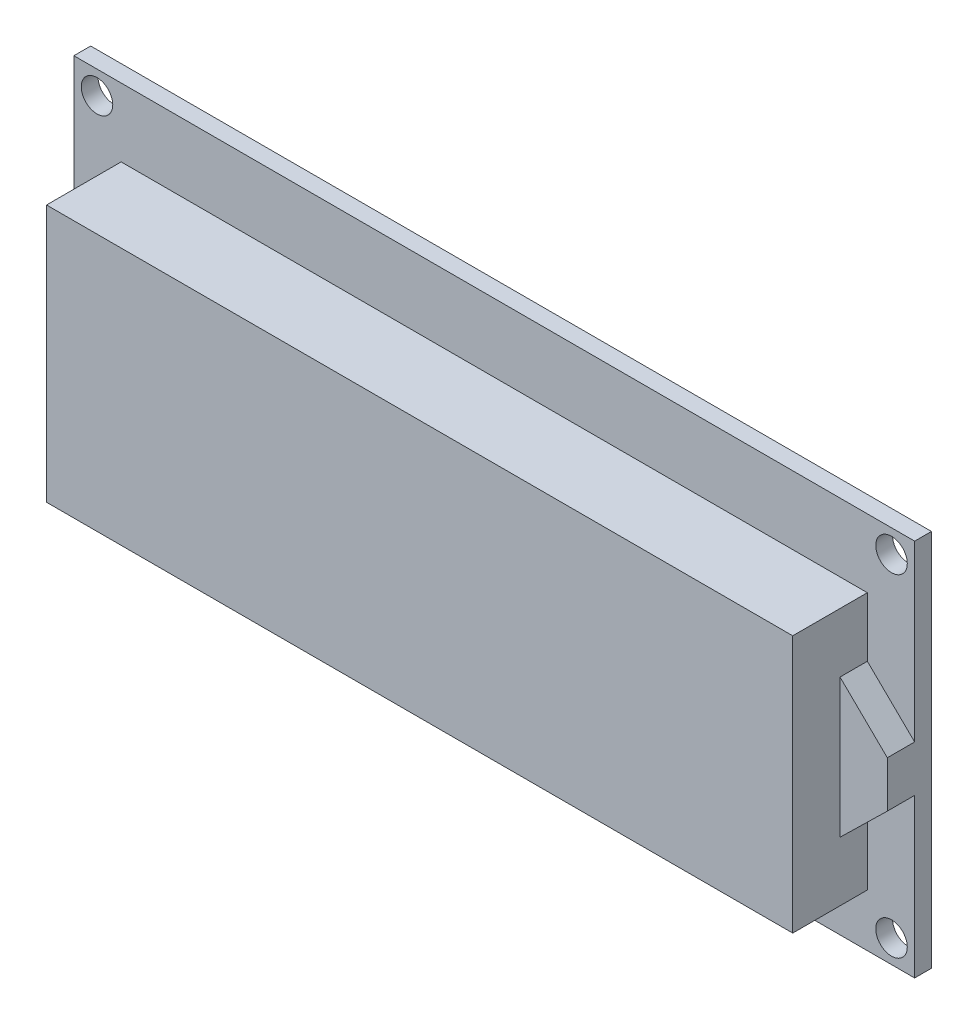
ISO-10303-21;
HEADER;
FILE_DESCRIPTION(('STEP AP214'),'2;1');
FILE_NAME('part.step','',(''),(''),'','','');
FILE_SCHEMA(('AUTOMOTIVE_DESIGN { 1 0 10303 214 1 1 1 1 }'));
ENDSEC;
DATA;
#1=APPLICATION_CONTEXT('core data for automotive mechanical design processes');
#2=APPLICATION_PROTOCOL_DEFINITION('international standard','automotive_design',2000,#1);
#3=PRODUCT_CONTEXT('',#1,'mechanical');
#4=PRODUCT('Part','Part','',(#3));
#5=PRODUCT_RELATED_PRODUCT_CATEGORY('part','',(#4));
#6=PRODUCT_DEFINITION_FORMATION('','',#4);
#7=PRODUCT_DEFINITION_CONTEXT('part definition',#1,'design');
#8=PRODUCT_DEFINITION('design','',#6,#7);
#9=PRODUCT_DEFINITION_SHAPE('','',#8);
#10=(LENGTH_UNIT() NAMED_UNIT(*) SI_UNIT(.MILLI.,.METRE.));
#11=(NAMED_UNIT(*) PLANE_ANGLE_UNIT() SI_UNIT($,.RADIAN.));
#12=(NAMED_UNIT(*) SI_UNIT($,.STERADIAN.) SOLID_ANGLE_UNIT());
#13=UNCERTAINTY_MEASURE_WITH_UNIT(LENGTH_MEASURE(1.E-05),#10,'distance_accuracy_value','');
#14=(GEOMETRIC_REPRESENTATION_CONTEXT(3) GLOBAL_UNCERTAINTY_ASSIGNED_CONTEXT((#13)) GLOBAL_UNIT_ASSIGNED_CONTEXT((#10,
#11,#12)) REPRESENTATION_CONTEXT('',''));
#15=CARTESIAN_POINT('',(0.,0.,0.));
#16=DIRECTION('',(0.,0.,1.));
#17=DIRECTION('',(1.,0.,0.));
#18=AXIS2_PLACEMENT_3D('',#15,#16,#17);
#19=CARTESIAN_POINT('',(0.,18.,-1.6));
#20=DIRECTION('',(0.,1.,0.));
#21=DIRECTION('',(-1.,0.,0.));
#22=AXIS2_PLACEMENT_3D('',#19,#20,#21);
#23=PLANE('',#22);
#24=DIRECTION('',(-1.,0.,0.));
#25=VECTOR('',#24,1.);
#26=CARTESIAN_POINT('',(0.,18.,0.));
#27=LINE('',#26,#25);
#28=CARTESIAN_POINT('',(40.,18.,0.));
#29=VERTEX_POINT('',#28);
#30=CARTESIAN_POINT('',(-40.,18.,0.));
#31=VERTEX_POINT('',#30);
#32=EDGE_CURVE('E223',#29,#31,#27,.T.);
#33=ORIENTED_EDGE('',*,*,#32,.F.);
#34=DIRECTION('',(0.,0.,1.));
#35=VECTOR('',#34,1.);
#36=CARTESIAN_POINT('',(40.,18.,-1.6));
#37=LINE('',#36,#35);
#38=CARTESIAN_POINT('',(40.,18.,-1.6));
#39=VERTEX_POINT('',#38);
#40=EDGE_CURVE('E71',#39,#29,#37,.T.);
#41=ORIENTED_EDGE('',*,*,#40,.F.);
#42=DIRECTION('',(-1.,0.,0.));
#43=VECTOR('',#42,1.);
#44=CARTESIAN_POINT('',(0.,18.,-1.6));
#45=LINE('',#44,#43);
#46=CARTESIAN_POINT('',(-40.,18.,-1.6));
#47=VERTEX_POINT('',#46);
#48=EDGE_CURVE('E239',#39,#47,#45,.T.);
#49=ORIENTED_EDGE('',*,*,#48,.T.);
#50=DIRECTION('',(0.,0.,1.));
#51=VECTOR('',#50,1.);
#52=CARTESIAN_POINT('',(-40.,18.,-1.6));
#53=LINE('',#52,#51);
#54=EDGE_CURVE('E12',#47,#31,#53,.T.);
#55=ORIENTED_EDGE('',*,*,#54,.T.);
#56=EDGE_LOOP('',(#33,#41,#49,#55));
#57=FACE_BOUND('',#56,.T.);
#58=ADVANCED_FACE('F62',(#57),#23,.T.);
#59=CARTESIAN_POINT('',(40.,0.,-1.6));
#60=DIRECTION('',(1.,0.,0.));
#61=DIRECTION('',(0.,0.,-1.));
#62=AXIS2_PLACEMENT_3D('',#59,#60,#61);
#63=PLANE('',#62);
#64=DIRECTION('',(0.,1.,0.));
#65=VECTOR('',#64,1.);
#66=CARTESIAN_POINT('',(40.,0.,0.));
#67=LINE('',#66,#65);
#68=CARTESIAN_POINT('',(40.,-18.,0.));
#69=VERTEX_POINT('',#68);
#70=CARTESIAN_POINT('',(40.,-2.95,0.));
#71=VERTEX_POINT('',#70);
#72=EDGE_CURVE('E86',#69,#71,#67,.T.);
#73=ORIENTED_EDGE('',*,*,#72,.F.);
#74=DIRECTION('',(0.,0.,1.));
#75=VECTOR('',#74,1.);
#76=CARTESIAN_POINT('',(40.,-18.,-1.6));
#77=LINE('',#76,#75);
#78=CARTESIAN_POINT('',(40.,-18.,-1.6));
#79=VERTEX_POINT('',#78);
#80=EDGE_CURVE('E263',#79,#69,#77,.T.);
#81=ORIENTED_EDGE('',*,*,#80,.F.);
#82=DIRECTION('',(0.,1.,0.));
#83=VECTOR('',#82,1.);
#84=CARTESIAN_POINT('',(40.,0.,-1.6));
#85=LINE('',#84,#83);
#86=EDGE_CURVE('E236',#79,#39,#85,.T.);
#87=ORIENTED_EDGE('',*,*,#86,.T.);
#88=ORIENTED_EDGE('',*,*,#40,.T.);
#89=CARTESIAN_POINT('',(40.,1.45,0.));
#90=VERTEX_POINT('',#89);
#91=EDGE_CURVE('E258',#90,#29,#67,.T.);
#92=ORIENTED_EDGE('',*,*,#91,.F.);
#93=DIRECTION('',(0.,0.,-1.));
#94=VECTOR('',#93,1.);
#95=CARTESIAN_POINT('',(40.,1.45,2.6));
#96=LINE('',#95,#94);
#97=CARTESIAN_POINT('',(40.,1.45,2.6));
#98=VERTEX_POINT('',#97);
#99=EDGE_CURVE('E178',#98,#90,#96,.T.);
#100=ORIENTED_EDGE('',*,*,#99,.F.);
#101=DIRECTION('',(0.,1.,0.));
#102=VECTOR('',#101,1.);
#103=CARTESIAN_POINT('',(40.,0.,2.6));
#104=LINE('',#103,#102);
#105=CARTESIAN_POINT('',(40.,-2.95,2.6));
#106=VERTEX_POINT('',#105);
#107=EDGE_CURVE('E176',#106,#98,#104,.T.);
#108=ORIENTED_EDGE('',*,*,#107,.F.);
#109=DIRECTION('',(0.,0.,-1.));
#110=VECTOR('',#109,1.);
#111=CARTESIAN_POINT('',(40.,-2.95,2.6));
#112=LINE('',#111,#110);
#113=EDGE_CURVE('E164',#106,#71,#112,.T.);
#114=ORIENTED_EDGE('',*,*,#113,.T.);
#115=EDGE_LOOP('',(#73,#81,#87,#88,#92,#100,#108,#114));
#116=FACE_BOUND('',#115,.T.);
#117=ADVANCED_FACE('F283',(#116),#63,.T.);
#118=CARTESIAN_POINT('',(0.,-18.,-1.6));
#119=DIRECTION('',(0.,1.,0.));
#120=DIRECTION('',(-1.,0.,0.));
#121=AXIS2_PLACEMENT_3D('',#118,#119,#120);
#122=PLANE('',#121);
#123=DIRECTION('',(-1.,0.,0.));
#124=VECTOR('',#123,1.);
#125=CARTESIAN_POINT('',(0.,-18.,0.));
#126=LINE('',#125,#124);
#127=CARTESIAN_POINT('',(-40.,-18.,0.));
#128=VERTEX_POINT('',#127);
#129=EDGE_CURVE('E256',#69,#128,#126,.T.);
#130=ORIENTED_EDGE('',*,*,#129,.T.);
#131=DIRECTION('',(0.,0.,1.));
#132=VECTOR('',#131,1.);
#133=CARTESIAN_POINT('',(-40.,-18.,-1.6));
#134=LINE('',#133,#132);
#135=CARTESIAN_POINT('',(-40.,-18.,-1.6));
#136=VERTEX_POINT('',#135);
#137=EDGE_CURVE('E66',#136,#128,#134,.T.);
#138=ORIENTED_EDGE('',*,*,#137,.F.);
#139=DIRECTION('',(-1.,0.,0.));
#140=VECTOR('',#139,1.);
#141=CARTESIAN_POINT('',(0.,-18.,-1.6));
#142=LINE('',#141,#140);
#143=EDGE_CURVE('E234',#79,#136,#142,.T.);
#144=ORIENTED_EDGE('',*,*,#143,.F.);
#145=ORIENTED_EDGE('',*,*,#80,.T.);
#146=EDGE_LOOP('',(#130,#138,#144,#145));
#147=FACE_BOUND('',#146,.T.);
#148=ADVANCED_FACE('F281',(#147),#122,.F.);
#149=CARTESIAN_POINT('',(-40.,0.,-1.6));
#150=DIRECTION('',(1.,0.,0.));
#151=DIRECTION('',(0.,0.,-1.));
#152=AXIS2_PLACEMENT_3D('',#149,#150,#151);
#153=PLANE('',#152);
#154=DIRECTION('',(0.,1.,0.));
#155=VECTOR('',#154,1.);
#156=CARTESIAN_POINT('',(-40.,0.,0.));
#157=LINE('',#156,#155);
#158=EDGE_CURVE('E253',#128,#31,#157,.T.);
#159=ORIENTED_EDGE('',*,*,#158,.T.);
#160=ORIENTED_EDGE('',*,*,#54,.F.);
#161=DIRECTION('',(0.,1.,0.));
#162=VECTOR('',#161,1.);
#163=CARTESIAN_POINT('',(-40.,0.,-1.6));
#164=LINE('',#163,#162);
#165=EDGE_CURVE('E232',#136,#47,#164,.T.);
#166=ORIENTED_EDGE('',*,*,#165,.F.);
#167=ORIENTED_EDGE('',*,*,#137,.T.);
#168=EDGE_LOOP('',(#159,#160,#166,#167));
#169=FACE_BOUND('',#168,.T.);
#170=ADVANCED_FACE('F271',(#169),#153,.F.);
#171=CARTESIAN_POINT('',(-37.8,-15.8,-1.6));
#172=DIRECTION('',(0.,0.,1.));
#173=DIRECTION('',(1.,0.,0.));
#174=AXIS2_PLACEMENT_3D('',#171,#172,#173);
#175=CYLINDRICAL_SURFACE('',#174,1.5);
#176=CARTESIAN_POINT('',(-37.8,-15.8,-1.6));
#177=DIRECTION('',(0.,0.,1.));
#178=DIRECTION('',(1.,0.,0.));
#179=AXIS2_PLACEMENT_3D('',#176,#177,#178);
#180=CIRCLE('',#179,1.5);
#181=CARTESIAN_POINT('',(-36.3,-15.8,-1.6));
#182=VERTEX_POINT('',#181);
#183=EDGE_CURVE('E229',#182,#182,#180,.T.);
#184=ORIENTED_EDGE('',*,*,#183,.F.);
#185=EDGE_LOOP('',(#184));
#186=FACE_BOUND('',#185,.T.);
#187=CARTESIAN_POINT('',(-37.8,-15.8,0.));
#188=DIRECTION('',(0.,0.,1.));
#189=DIRECTION('',(1.,0.,0.));
#190=AXIS2_PLACEMENT_3D('',#187,#188,#189);
#191=CIRCLE('',#190,1.5);
#192=CARTESIAN_POINT('',(-36.3,-15.8,0.));
#193=VERTEX_POINT('',#192);
#194=EDGE_CURVE('E250',#193,#193,#191,.T.);
#195=ORIENTED_EDGE('',*,*,#194,.T.);
#196=EDGE_LOOP('',(#195));
#197=FACE_BOUND('',#196,.T.);
#198=ADVANCED_FACE('F289',(#186,#197),#175,.F.);
#199=CARTESIAN_POINT('',(-37.8,15.8,-1.6));
#200=DIRECTION('',(0.,0.,1.));
#201=DIRECTION('',(1.,0.,0.));
#202=AXIS2_PLACEMENT_3D('',#199,#200,#201);
#203=CYLINDRICAL_SURFACE('',#202,1.5);
#204=CARTESIAN_POINT('',(-37.8,15.8,-1.6));
#205=DIRECTION('',(0.,0.,1.));
#206=DIRECTION('',(1.,0.,0.));
#207=AXIS2_PLACEMENT_3D('',#204,#205,#206);
#208=CIRCLE('',#207,1.5);
#209=CARTESIAN_POINT('',(-36.3,15.8,-1.6));
#210=VERTEX_POINT('',#209);
#211=EDGE_CURVE('E226',#210,#210,#208,.T.);
#212=ORIENTED_EDGE('',*,*,#211,.F.);
#213=EDGE_LOOP('',(#212));
#214=FACE_BOUND('',#213,.T.);
#215=CARTESIAN_POINT('',(-37.8,15.8,0.));
#216=DIRECTION('',(0.,0.,1.));
#217=DIRECTION('',(1.,0.,0.));
#218=AXIS2_PLACEMENT_3D('',#215,#216,#217);
#219=CIRCLE('',#218,1.5);
#220=CARTESIAN_POINT('',(-36.3,15.8,0.));
#221=VERTEX_POINT('',#220);
#222=EDGE_CURVE('E247',#221,#221,#219,.T.);
#223=ORIENTED_EDGE('',*,*,#222,.T.);
#224=EDGE_LOOP('',(#223));
#225=FACE_BOUND('',#224,.T.);
#226=ADVANCED_FACE('F380',(#214,#225),#203,.F.);
#227=CARTESIAN_POINT('',(37.8,15.8,-1.6));
#228=DIRECTION('',(0.,0.,1.));
#229=DIRECTION('',(1.,0.,0.));
#230=AXIS2_PLACEMENT_3D('',#227,#228,#229);
#231=CYLINDRICAL_SURFACE('',#230,1.5);
#232=CARTESIAN_POINT('',(37.8,15.8,-1.6));
#233=DIRECTION('',(0.,0.,1.));
#234=DIRECTION('',(1.,0.,0.));
#235=AXIS2_PLACEMENT_3D('',#232,#233,#234);
#236=CIRCLE('',#235,1.5);
#237=CARTESIAN_POINT('',(39.3,15.8,-1.6));
#238=VERTEX_POINT('',#237);
#239=EDGE_CURVE('E222',#238,#238,#236,.T.);
#240=ORIENTED_EDGE('',*,*,#239,.F.);
#241=EDGE_LOOP('',(#240));
#242=FACE_BOUND('',#241,.T.);
#243=CARTESIAN_POINT('',(37.8,15.8,0.));
#244=DIRECTION('',(0.,0.,1.));
#245=DIRECTION('',(1.,0.,0.));
#246=AXIS2_PLACEMENT_3D('',#243,#244,#245);
#247=CIRCLE('',#246,1.5);
#248=CARTESIAN_POINT('',(39.3,15.8,0.));
#249=VERTEX_POINT('',#248);
#250=EDGE_CURVE('E244',#249,#249,#247,.T.);
#251=ORIENTED_EDGE('',*,*,#250,.T.);
#252=EDGE_LOOP('',(#251));
#253=FACE_BOUND('',#252,.T.);
#254=ADVANCED_FACE('F373',(#242,#253),#231,.F.);
#255=CARTESIAN_POINT('',(37.8,-15.8,-1.6));
#256=DIRECTION('',(0.,0.,1.));
#257=DIRECTION('',(1.,0.,0.));
#258=AXIS2_PLACEMENT_3D('',#255,#256,#257);
#259=CYLINDRICAL_SURFACE('',#258,1.5);
#260=CARTESIAN_POINT('',(37.8,-15.8,-1.6));
#261=DIRECTION('',(0.,0.,1.));
#262=DIRECTION('',(1.,0.,0.));
#263=AXIS2_PLACEMENT_3D('',#260,#261,#262);
#264=CIRCLE('',#263,1.5);
#265=CARTESIAN_POINT('',(39.3,-15.8,-1.6));
#266=VERTEX_POINT('',#265);
#267=EDGE_CURVE('E219',#266,#266,#264,.T.);
#268=ORIENTED_EDGE('',*,*,#267,.F.);
#269=EDGE_LOOP('',(#268));
#270=FACE_BOUND('',#269,.T.);
#271=CARTESIAN_POINT('',(37.8,-15.8,0.));
#272=DIRECTION('',(0.,0.,1.));
#273=DIRECTION('',(1.,0.,0.));
#274=AXIS2_PLACEMENT_3D('',#271,#272,#273);
#275=CIRCLE('',#274,1.5);
#276=CARTESIAN_POINT('',(39.3,-15.8,0.));
#277=VERTEX_POINT('',#276);
#278=EDGE_CURVE('E218',#277,#277,#275,.T.);
#279=ORIENTED_EDGE('',*,*,#278,.T.);
#280=EDGE_LOOP('',(#279));
#281=FACE_BOUND('',#280,.T.);
#282=ADVANCED_FACE('F64',(#270,#281),#259,.F.);
#283=CARTESIAN_POINT('',(0.,0.,0.));
#284=DIRECTION('',(0.,0.,1.));
#285=DIRECTION('',(1.,0.,0.));
#286=AXIS2_PLACEMENT_3D('',#283,#284,#285);
#287=PLANE('',#286);
#288=DIRECTION('',(0.715006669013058,-0.699117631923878,0.));
#289=VECTOR('',#288,1.);
#290=CARTESIAN_POINT('',(20.2754354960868,20.7362408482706,0.));
#291=LINE('',#290,#289);
#292=CARTESIAN_POINT('',(35.5,5.85,0.));
#293=VERTEX_POINT('',#292);
#294=EDGE_CURVE('E79',#293,#90,#291,.T.);
#295=ORIENTED_EDGE('',*,*,#294,.T.);
#296=ORIENTED_EDGE('',*,*,#91,.T.);
#297=ORIENTED_EDGE('',*,*,#32,.T.);
#298=ORIENTED_EDGE('',*,*,#158,.F.);
#299=ORIENTED_EDGE('',*,*,#129,.F.);
#300=ORIENTED_EDGE('',*,*,#72,.T.);
#301=DIRECTION('',(-0.715006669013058,-0.699117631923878,0.));
#302=VECTOR('',#301,1.);
#303=CARTESIAN_POINT('',(21.0252461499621,-21.5030926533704,0.));
#304=LINE('',#303,#302);
#305=CARTESIAN_POINT('',(35.5,-7.34999999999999,0.));
#306=VERTEX_POINT('',#305);
#307=EDGE_CURVE('E183',#71,#306,#304,.T.);
#308=ORIENTED_EDGE('',*,*,#307,.T.);
#309=DIRECTION('',(0.,-1.,0.));
#310=VECTOR('',#309,1.);
#311=CARTESIAN_POINT('',(35.5,0.,0.));
#312=LINE('',#311,#310);
#313=CARTESIAN_POINT('',(35.5,-13.,0.));
#314=VERTEX_POINT('',#313);
#315=EDGE_CURVE('E159',#306,#314,#312,.T.);
#316=ORIENTED_EDGE('',*,*,#315,.T.);
#317=DIRECTION('',(1.,0.,0.));
#318=VECTOR('',#317,1.);
#319=CARTESIAN_POINT('',(0.,-13.,0.));
#320=LINE('',#319,#318);
#321=CARTESIAN_POINT('',(-35.5,-13.,0.));
#322=VERTEX_POINT('',#321);
#323=EDGE_CURVE('E193',#322,#314,#320,.T.);
#324=ORIENTED_EDGE('',*,*,#323,.F.);
#325=DIRECTION('',(0.,-1.,0.));
#326=VECTOR('',#325,1.);
#327=CARTESIAN_POINT('',(-35.5,0.,0.));
#328=LINE('',#327,#326);
#329=CARTESIAN_POINT('',(-35.5,11.5,0.));
#330=VERTEX_POINT('',#329);
#331=EDGE_CURVE('E206',#330,#322,#328,.T.);
#332=ORIENTED_EDGE('',*,*,#331,.F.);
#333=DIRECTION('',(1.,0.,0.));
#334=VECTOR('',#333,1.);
#335=CARTESIAN_POINT('',(0.,11.5,0.));
#336=LINE('',#335,#334);
#337=CARTESIAN_POINT('',(35.5,11.5,0.));
#338=VERTEX_POINT('',#337);
#339=EDGE_CURVE('E203',#330,#338,#336,.T.);
#340=ORIENTED_EDGE('',*,*,#339,.T.);
#341=EDGE_CURVE('E201',#338,#293,#312,.T.);
#342=ORIENTED_EDGE('',*,*,#341,.T.);
#343=EDGE_LOOP('',(#295,#296,#297,#298,#299,#300,#308,#316,#324,#332,#340,#342));
#344=FACE_BOUND('',#343,.T.);
#345=ORIENTED_EDGE('',*,*,#278,.F.);
#346=EDGE_LOOP('',(#345));
#347=FACE_BOUND('',#346,.T.);
#348=ORIENTED_EDGE('',*,*,#250,.F.);
#349=EDGE_LOOP('',(#348));
#350=FACE_BOUND('',#349,.T.);
#351=ORIENTED_EDGE('',*,*,#222,.F.);
#352=EDGE_LOOP('',(#351));
#353=FACE_BOUND('',#352,.T.);
#354=ORIENTED_EDGE('',*,*,#194,.F.);
#355=EDGE_LOOP('',(#354));
#356=FACE_BOUND('',#355,.T.);
#357=ADVANCED_FACE('F273',(#344,#347,#350,#353,#356),#287,.T.);
#358=CARTESIAN_POINT('',(0.,0.,-1.6));
#359=DIRECTION('',(0.,0.,1.));
#360=DIRECTION('',(1.,0.,0.));
#361=AXIS2_PLACEMENT_3D('',#358,#359,#360);
#362=PLANE('',#361);
#363=ORIENTED_EDGE('',*,*,#267,.T.);
#364=EDGE_LOOP('',(#363));
#365=FACE_BOUND('',#364,.T.);
#366=ORIENTED_EDGE('',*,*,#239,.T.);
#367=EDGE_LOOP('',(#366));
#368=FACE_BOUND('',#367,.T.);
#369=ORIENTED_EDGE('',*,*,#211,.T.);
#370=EDGE_LOOP('',(#369));
#371=FACE_BOUND('',#370,.T.);
#372=ORIENTED_EDGE('',*,*,#183,.T.);
#373=EDGE_LOOP('',(#372));
#374=FACE_BOUND('',#373,.T.);
#375=ORIENTED_EDGE('',*,*,#165,.T.);
#376=ORIENTED_EDGE('',*,*,#48,.F.);
#377=ORIENTED_EDGE('',*,*,#86,.F.);
#378=ORIENTED_EDGE('',*,*,#143,.T.);
#379=EDGE_LOOP('',(#375,#376,#377,#378));
#380=FACE_BOUND('',#379,.T.);
#381=ADVANCED_FACE('F280',(#365,#368,#371,#374,#380),#362,.F.);
#382=CARTESIAN_POINT('',(35.5,0.,7.1));
#383=DIRECTION('',(1.,0.,0.));
#384=DIRECTION('',(0.,1.,0.));
#385=AXIS2_PLACEMENT_3D('',#382,#383,#384);
#386=PLANE('',#385);
#387=DIRECTION('',(0.,0.,-1.));
#388=VECTOR('',#387,1.);
#389=CARTESIAN_POINT('',(35.5,5.85,2.6));
#390=LINE('',#389,#388);
#391=CARTESIAN_POINT('',(35.5,5.85,2.6));
#392=VERTEX_POINT('',#391);
#393=EDGE_CURVE('E163',#392,#293,#390,.T.);
#394=ORIENTED_EDGE('',*,*,#393,.T.);
#395=ORIENTED_EDGE('',*,*,#341,.F.);
#396=DIRECTION('',(0.,0.,-1.));
#397=VECTOR('',#396,1.);
#398=CARTESIAN_POINT('',(35.5,11.5,7.1));
#399=LINE('',#398,#397);
#400=CARTESIAN_POINT('',(35.5,11.5,7.1));
#401=VERTEX_POINT('',#400);
#402=EDGE_CURVE('E216',#401,#338,#399,.T.);
#403=ORIENTED_EDGE('',*,*,#402,.F.);
#404=DIRECTION('',(0.,-1.,0.));
#405=VECTOR('',#404,1.);
#406=CARTESIAN_POINT('',(35.5,0.,7.1));
#407=LINE('',#406,#405);
#408=CARTESIAN_POINT('',(35.5,-13.,7.1));
#409=VERTEX_POINT('',#408);
#410=EDGE_CURVE('E189',#401,#409,#407,.T.);
#411=ORIENTED_EDGE('',*,*,#410,.T.);
#412=DIRECTION('',(0.,0.,-1.));
#413=VECTOR('',#412,1.);
#414=CARTESIAN_POINT('',(35.5,-13.,7.1));
#415=LINE('',#414,#413);
#416=EDGE_CURVE('E200',#409,#314,#415,.T.);
#417=ORIENTED_EDGE('',*,*,#416,.T.);
#418=ORIENTED_EDGE('',*,*,#315,.F.);
#419=DIRECTION('',(0.,0.,-1.));
#420=VECTOR('',#419,1.);
#421=CARTESIAN_POINT('',(35.5,-7.34999999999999,2.6));
#422=LINE('',#421,#420);
#423=CARTESIAN_POINT('',(35.5,-7.34999999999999,2.6));
#424=VERTEX_POINT('',#423);
#425=EDGE_CURVE('E153',#424,#306,#422,.T.);
#426=ORIENTED_EDGE('',*,*,#425,.F.);
#427=DIRECTION('',(0.,-1.,0.));
#428=VECTOR('',#427,1.);
#429=CARTESIAN_POINT('',(35.5,0.,2.6));
#430=LINE('',#429,#428);
#431=EDGE_CURVE('E156',#392,#424,#430,.T.);
#432=ORIENTED_EDGE('',*,*,#431,.F.);
#433=EDGE_LOOP('',(#394,#395,#403,#411,#417,#418,#426,#432));
#434=FACE_BOUND('',#433,.T.);
#435=ADVANCED_FACE('F155',(#434),#386,.T.);
#436=CARTESIAN_POINT('',(0.,11.5,7.1));
#437=DIRECTION('',(0.,1.,0.));
#438=DIRECTION('',(0.,0.,1.));
#439=AXIS2_PLACEMENT_3D('',#436,#437,#438);
#440=PLANE('',#439);
#441=ORIENTED_EDGE('',*,*,#339,.F.);
#442=DIRECTION('',(0.,0.,-1.));
#443=VECTOR('',#442,1.);
#444=CARTESIAN_POINT('',(-35.5,11.5,7.1));
#445=LINE('',#444,#443);
#446=CARTESIAN_POINT('',(-35.5,11.5,7.1));
#447=VERTEX_POINT('',#446);
#448=EDGE_CURVE('E214',#447,#330,#445,.T.);
#449=ORIENTED_EDGE('',*,*,#448,.F.);
#450=DIRECTION('',(1.,0.,0.));
#451=VECTOR('',#450,1.);
#452=CARTESIAN_POINT('',(0.,11.5,7.1));
#453=LINE('',#452,#451);
#454=EDGE_CURVE('E192',#447,#401,#453,.T.);
#455=ORIENTED_EDGE('',*,*,#454,.T.);
#456=ORIENTED_EDGE('',*,*,#402,.T.);
#457=EDGE_LOOP('',(#441,#449,#455,#456));
#458=FACE_BOUND('',#457,.T.);
#459=ADVANCED_FACE('F305',(#458),#440,.T.);
#460=CARTESIAN_POINT('',(-35.5,0.,7.1));
#461=DIRECTION('',(1.,0.,0.));
#462=DIRECTION('',(0.,1.,0.));
#463=AXIS2_PLACEMENT_3D('',#460,#461,#462);
#464=PLANE('',#463);
#465=ORIENTED_EDGE('',*,*,#331,.T.);
#466=DIRECTION('',(0.,0.,-1.));
#467=VECTOR('',#466,1.);
#468=CARTESIAN_POINT('',(-35.5,-13.,7.1));
#469=LINE('',#468,#467);
#470=CARTESIAN_POINT('',(-35.5,-13.,7.1));
#471=VERTEX_POINT('',#470);
#472=EDGE_CURVE('E212',#471,#322,#469,.T.);
#473=ORIENTED_EDGE('',*,*,#472,.F.);
#474=DIRECTION('',(0.,-1.,0.));
#475=VECTOR('',#474,1.);
#476=CARTESIAN_POINT('',(-35.5,0.,7.1));
#477=LINE('',#476,#475);
#478=EDGE_CURVE('E196',#447,#471,#477,.T.);
#479=ORIENTED_EDGE('',*,*,#478,.F.);
#480=ORIENTED_EDGE('',*,*,#448,.T.);
#481=EDGE_LOOP('',(#465,#473,#479,#480));
#482=FACE_BOUND('',#481,.T.);
#483=ADVANCED_FACE('F308',(#482),#464,.F.);
#484=CARTESIAN_POINT('',(0.,-13.,7.1));
#485=DIRECTION('',(0.,1.,0.));
#486=DIRECTION('',(-1.,0.,0.));
#487=AXIS2_PLACEMENT_3D('',#484,#485,#486);
#488=PLANE('',#487);
#489=ORIENTED_EDGE('',*,*,#323,.T.);
#490=ORIENTED_EDGE('',*,*,#416,.F.);
#491=DIRECTION('',(1.,0.,0.));
#492=VECTOR('',#491,1.);
#493=CARTESIAN_POINT('',(0.,-13.,7.1));
#494=LINE('',#493,#492);
#495=EDGE_CURVE('E198',#471,#409,#494,.T.);
#496=ORIENTED_EDGE('',*,*,#495,.F.);
#497=ORIENTED_EDGE('',*,*,#472,.T.);
#498=EDGE_LOOP('',(#489,#490,#496,#497));
#499=FACE_BOUND('',#498,.T.);
#500=ADVANCED_FACE('F312',(#499),#488,.F.);
#501=CARTESIAN_POINT('',(0.,0.,7.1));
#502=DIRECTION('',(0.,0.,1.));
#503=DIRECTION('',(1.,0.,0.));
#504=AXIS2_PLACEMENT_3D('',#501,#502,#503);
#505=PLANE('',#504);
#506=ORIENTED_EDGE('',*,*,#410,.F.);
#507=ORIENTED_EDGE('',*,*,#454,.F.);
#508=ORIENTED_EDGE('',*,*,#478,.T.);
#509=ORIENTED_EDGE('',*,*,#495,.T.);
#510=EDGE_LOOP('',(#506,#507,#508,#509));
#511=FACE_BOUND('',#510,.T.);
#512=ADVANCED_FACE('F316',(#511),#505,.T.);
#513=CARTESIAN_POINT('',(20.2754354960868,20.7362408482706,2.6));
#514=DIRECTION('',(0.699117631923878,0.715006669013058,0.));
#515=DIRECTION('',(-0.715006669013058,0.699117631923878,0.));
#516=AXIS2_PLACEMENT_3D('',#513,#514,#515);
#517=PLANE('',#516);
#518=ORIENTED_EDGE('',*,*,#294,.F.);
#519=ORIENTED_EDGE('',*,*,#393,.F.);
#520=DIRECTION('',(0.715006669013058,-0.699117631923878,0.));
#521=VECTOR('',#520,1.);
#522=CARTESIAN_POINT('',(20.2754354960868,20.7362408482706,2.6));
#523=LINE('',#522,#521);
#524=EDGE_CURVE('E172',#392,#98,#523,.T.);
#525=ORIENTED_EDGE('',*,*,#524,.T.);
#526=ORIENTED_EDGE('',*,*,#99,.T.);
#527=EDGE_LOOP('',(#518,#519,#525,#526));
#528=FACE_BOUND('',#527,.T.);
#529=ADVANCED_FACE('F320',(#528),#517,.T.);
#530=CARTESIAN_POINT('',(21.0252461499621,-21.5030926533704,2.6));
#531=DIRECTION('',(0.699117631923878,-0.715006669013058,0.));
#532=DIRECTION('',(0.715006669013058,0.699117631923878,0.));
#533=AXIS2_PLACEMENT_3D('',#530,#531,#532);
#534=PLANE('',#533);
#535=ORIENTED_EDGE('',*,*,#307,.F.);
#536=ORIENTED_EDGE('',*,*,#113,.F.);
#537=DIRECTION('',(-0.715006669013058,-0.699117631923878,0.));
#538=VECTOR('',#537,1.);
#539=CARTESIAN_POINT('',(21.0252461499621,-21.5030926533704,2.6));
#540=LINE('',#539,#538);
#541=EDGE_CURVE('E170',#106,#424,#540,.T.);
#542=ORIENTED_EDGE('',*,*,#541,.T.);
#543=ORIENTED_EDGE('',*,*,#425,.T.);
#544=EDGE_LOOP('',(#535,#536,#542,#543));
#545=FACE_BOUND('',#544,.T.);
#546=ADVANCED_FACE('F174',(#545),#534,.T.);
#547=CARTESIAN_POINT('',(0.,0.,2.6));
#548=DIRECTION('',(0.,0.,1.));
#549=DIRECTION('',(1.,0.,0.));
#550=AXIS2_PLACEMENT_3D('',#547,#548,#549);
#551=PLANE('',#550);
#552=ORIENTED_EDGE('',*,*,#524,.F.);
#553=ORIENTED_EDGE('',*,*,#431,.T.);
#554=ORIENTED_EDGE('',*,*,#541,.F.);
#555=ORIENTED_EDGE('',*,*,#107,.T.);
#556=EDGE_LOOP('',(#552,#553,#554,#555));
#557=FACE_BOUND('',#556,.T.);
#558=ADVANCED_FACE('F169',(#557),#551,.T.);
#559=CLOSED_SHELL('',(#58,#117,#148,#170,#198,#226,#254,#282,#357,#381,#435,#459,#483,#500,#512,
#529,#546,#558));
#560=MANIFOLD_SOLID_BREP('B2',#559);
#561=ADVANCED_BREP_SHAPE_REPRESENTATION('',(#18,#560),#14);
#562=SHAPE_DEFINITION_REPRESENTATION(#9,#561);
ENDSEC;
END-ISO-10303-21;
